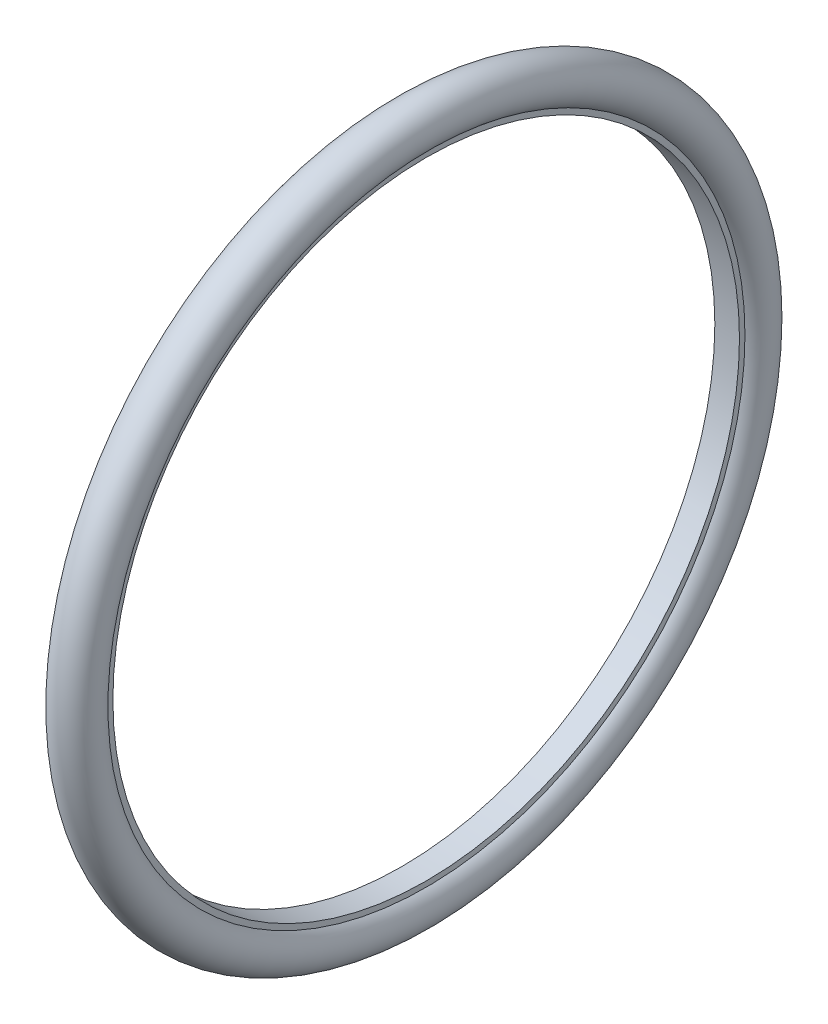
ISO-10303-21;
HEADER;
FILE_DESCRIPTION(('STEP AP214'),'2;1');
FILE_NAME('part.step','',(''),(''),'','','');
FILE_SCHEMA(('AUTOMOTIVE_DESIGN { 1 0 10303 214 1 1 1 1 }'));
ENDSEC;
DATA;
#1=APPLICATION_CONTEXT('core data for automotive mechanical design processes');
#2=APPLICATION_PROTOCOL_DEFINITION('international standard','automotive_design',2000,#1);
#3=PRODUCT_CONTEXT('',#1,'mechanical');
#4=PRODUCT('Part','Part','',(#3));
#5=PRODUCT_RELATED_PRODUCT_CATEGORY('part','',(#4));
#6=PRODUCT_DEFINITION_FORMATION('','',#4);
#7=PRODUCT_DEFINITION_CONTEXT('part definition',#1,'design');
#8=PRODUCT_DEFINITION('design','',#6,#7);
#9=PRODUCT_DEFINITION_SHAPE('','',#8);
#10=(LENGTH_UNIT() NAMED_UNIT(*) SI_UNIT(.MILLI.,.METRE.));
#11=(NAMED_UNIT(*) PLANE_ANGLE_UNIT() SI_UNIT($,.RADIAN.));
#12=(NAMED_UNIT(*) SI_UNIT($,.STERADIAN.) SOLID_ANGLE_UNIT());
#13=UNCERTAINTY_MEASURE_WITH_UNIT(LENGTH_MEASURE(1.E-05),#10,'distance_accuracy_value','');
#14=(GEOMETRIC_REPRESENTATION_CONTEXT(3) GLOBAL_UNCERTAINTY_ASSIGNED_CONTEXT((#13)) GLOBAL_UNIT_ASSIGNED_CONTEXT((#10,
#11,#12)) REPRESENTATION_CONTEXT('',''));
#15=CARTESIAN_POINT('',(0.,0.,0.));
#16=DIRECTION('',(0.,0.,1.));
#17=DIRECTION('',(1.,0.,0.));
#18=AXIS2_PLACEMENT_3D('',#15,#16,#17);
#19=CARTESIAN_POINT('',(60.25,0.,0.));
#20=DIRECTION('',(1.,0.,0.));
#21=DIRECTION('',(0.,0.,-1.));
#22=AXIS2_PLACEMENT_3D('',#19,#20,#21);
#23=TOROIDAL_SURFACE('',#22,306.569852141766,20.);
#24=CARTESIAN_POINT('',(49.05,0.,0.));
#25=DIRECTION('',(1.,0.,0.));
#26=DIRECTION('',(0.,0.,-1.));
#27=AXIS2_PLACEMENT_3D('',#24,#25,#26);
#28=CIRCLE('',#27,290.);
#29=CARTESIAN_POINT('',(49.05,0.,-290.));
#30=VERTEX_POINT('',#29);
#31=EDGE_CURVE('E10',#30,#30,#28,.T.);
#32=ORIENTED_EDGE('',*,*,#31,.T.);
#33=EDGE_LOOP('',(#32));
#34=FACE_BOUND('',#33,.T.);
#35=CARTESIAN_POINT('',(71.45,0.,0.));
#36=DIRECTION('',(1.,0.,0.));
#37=DIRECTION('',(0.,0.,-1.));
#38=AXIS2_PLACEMENT_3D('',#35,#36,#37);
#39=CIRCLE('',#38,290.);
#40=CARTESIAN_POINT('',(71.45,0.,-290.));
#41=VERTEX_POINT('',#40);
#42=EDGE_CURVE('E42',#41,#41,#39,.T.);
#43=ORIENTED_EDGE('',*,*,#42,.F.);
#44=EDGE_LOOP('',(#43));
#45=FACE_BOUND('',#44,.T.);
#46=ADVANCED_FACE('F28',(#34,#45),#23,.T.);
#47=CARTESIAN_POINT('',(49.05,290.,0.));
#48=DIRECTION('',(-1.,0.,0.));
#49=DIRECTION('',(0.,0.,1.));
#50=AXIS2_PLACEMENT_3D('',#47,#48,#49);
#51=PLANE('',#50);
#52=CARTESIAN_POINT('',(49.05,0.,0.));
#53=DIRECTION('',(1.,0.,0.));
#54=DIRECTION('',(0.,0.,-1.));
#55=AXIS2_PLACEMENT_3D('',#52,#53,#54);
#56=CIRCLE('',#55,285.);
#57=CARTESIAN_POINT('',(49.05,0.,-285.));
#58=VERTEX_POINT('',#57);
#59=EDGE_CURVE('E34',#58,#58,#56,.T.);
#60=ORIENTED_EDGE('',*,*,#59,.T.);
#61=EDGE_LOOP('',(#60));
#62=FACE_BOUND('',#61,.T.);
#63=ORIENTED_EDGE('',*,*,#31,.F.);
#64=EDGE_LOOP('',(#63));
#65=FACE_BOUND('',#64,.T.);
#66=ADVANCED_FACE('F52',(#62,#65),#51,.T.);
#67=CARTESIAN_POINT('',(88.701131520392,0.,0.));
#68=DIRECTION('',(1.,0.,0.));
#69=DIRECTION('',(0.,0.,-1.));
#70=AXIS2_PLACEMENT_3D('',#67,#68,#69);
#71=CYLINDRICAL_SURFACE('',#70,285.);
#72=CARTESIAN_POINT('',(71.45,0.,0.));
#73=DIRECTION('',(1.,0.,0.));
#74=DIRECTION('',(0.,0.,-1.));
#75=AXIS2_PLACEMENT_3D('',#72,#73,#74);
#76=CIRCLE('',#75,285.);
#77=CARTESIAN_POINT('',(71.45,0.,-285.));
#78=VERTEX_POINT('',#77);
#79=EDGE_CURVE('E38',#78,#78,#76,.T.);
#80=ORIENTED_EDGE('',*,*,#79,.T.);
#81=EDGE_LOOP('',(#80));
#82=FACE_BOUND('',#81,.T.);
#83=ORIENTED_EDGE('',*,*,#59,.F.);
#84=EDGE_LOOP('',(#83));
#85=FACE_BOUND('',#84,.T.);
#86=ADVANCED_FACE('F56',(#82,#85),#71,.F.);
#87=CARTESIAN_POINT('',(71.45,290.,0.));
#88=DIRECTION('',(1.,0.,0.));
#89=DIRECTION('',(0.,0.,-1.));
#90=AXIS2_PLACEMENT_3D('',#87,#88,#89);
#91=PLANE('',#90);
#92=ORIENTED_EDGE('',*,*,#42,.T.);
#93=EDGE_LOOP('',(#92));
#94=FACE_BOUND('',#93,.T.);
#95=ORIENTED_EDGE('',*,*,#79,.F.);
#96=EDGE_LOOP('',(#95));
#97=FACE_BOUND('',#96,.T.);
#98=ADVANCED_FACE('F48',(#94,#97),#91,.T.);
#99=CLOSED_SHELL('',(#46,#66,#86,#98));
#100=MANIFOLD_SOLID_BREP('B2',#99);
#101=ADVANCED_BREP_SHAPE_REPRESENTATION('',(#18,#100),#14);
#102=SHAPE_DEFINITION_REPRESENTATION(#9,#101);
ENDSEC;
END-ISO-10303-21;
